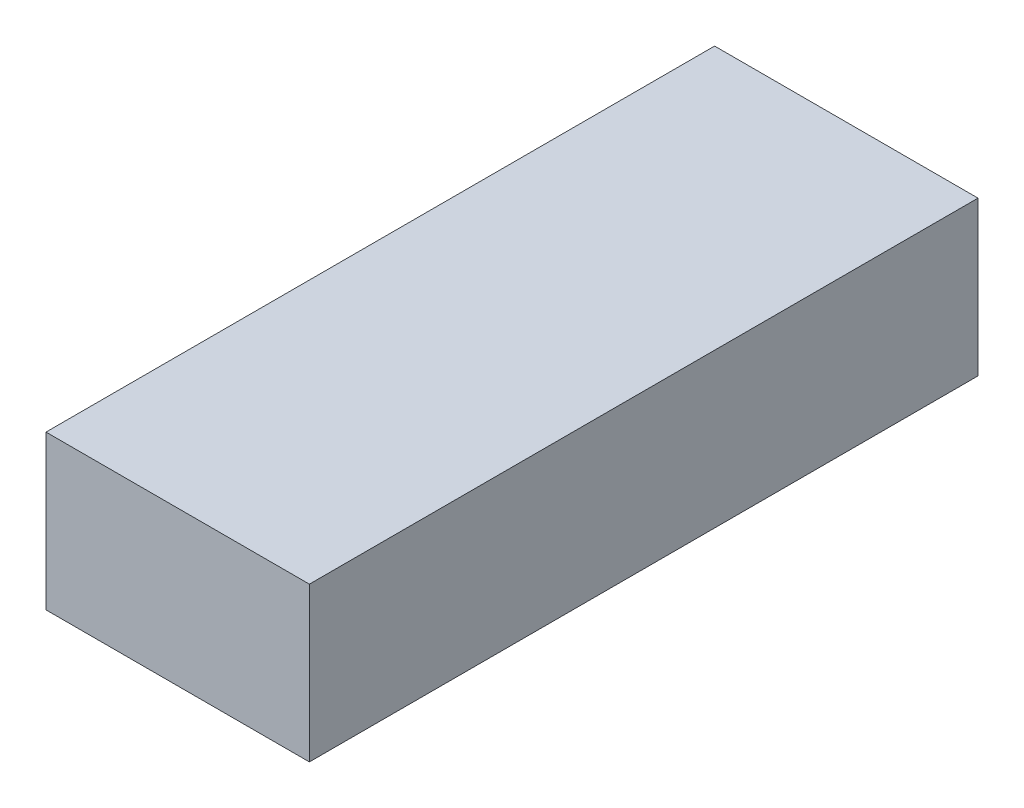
from build123d import *

# Parameters (mm, degrees)
SKETCH1_W           = 65
SKETCH1_H           = 38
BOSS_EXTRUDE1_DEPTH = 165


with BuildPart() as part:
    # Sketch1 → Boss-Extrude1 (new body)
    with BuildSketch(Plane.XY):
        with Locations((-32.5, 19)):
            Rectangle(SKETCH1_W, SKETCH1_H)
    extrude(amount=BOSS_EXTRUDE1_DEPTH)


solid = part.part
